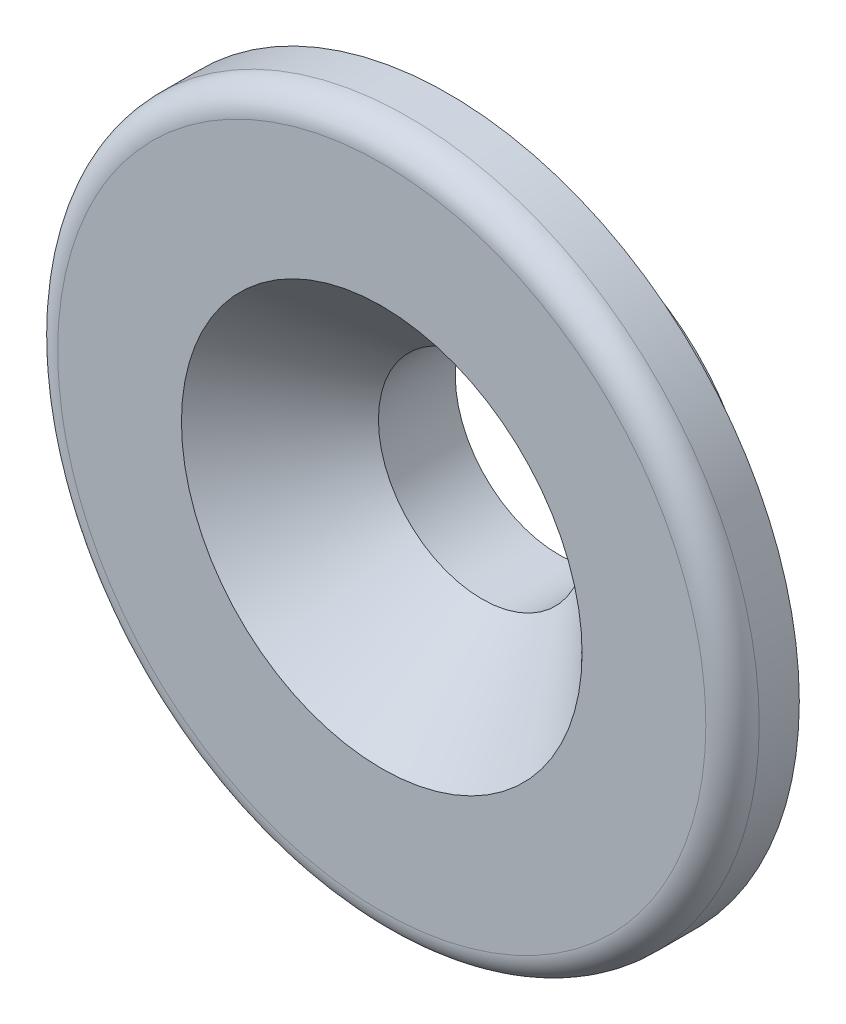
ISO-10303-21;
HEADER;
FILE_DESCRIPTION(('STEP AP214'),'2;1');
FILE_NAME('part.step','',(''),(''),'','','');
FILE_SCHEMA(('AUTOMOTIVE_DESIGN { 1 0 10303 214 1 1 1 1 }'));
ENDSEC;
DATA;
#1=APPLICATION_CONTEXT('core data for automotive mechanical design processes');
#2=APPLICATION_PROTOCOL_DEFINITION('international standard','automotive_design',2000,#1);
#3=PRODUCT_CONTEXT('',#1,'mechanical');
#4=PRODUCT('Part','Part','',(#3));
#5=PRODUCT_RELATED_PRODUCT_CATEGORY('part','',(#4));
#6=PRODUCT_DEFINITION_FORMATION('','',#4);
#7=PRODUCT_DEFINITION_CONTEXT('part definition',#1,'design');
#8=PRODUCT_DEFINITION('design','',#6,#7);
#9=PRODUCT_DEFINITION_SHAPE('','',#8);
#10=(LENGTH_UNIT() NAMED_UNIT(*) SI_UNIT(.MILLI.,.METRE.));
#11=(NAMED_UNIT(*) PLANE_ANGLE_UNIT() SI_UNIT($,.RADIAN.));
#12=(NAMED_UNIT(*) SI_UNIT($,.STERADIAN.) SOLID_ANGLE_UNIT());
#13=UNCERTAINTY_MEASURE_WITH_UNIT(LENGTH_MEASURE(1.E-05),#10,'distance_accuracy_value','');
#14=(GEOMETRIC_REPRESENTATION_CONTEXT(3) GLOBAL_UNCERTAINTY_ASSIGNED_CONTEXT((#13)) GLOBAL_UNIT_ASSIGNED_CONTEXT((#10,
#11,#12)) REPRESENTATION_CONTEXT('',''));
#15=CARTESIAN_POINT('',(0.,0.,0.));
#16=DIRECTION('',(0.,0.,1.));
#17=DIRECTION('',(1.,0.,0.));
#18=AXIS2_PLACEMENT_3D('',#15,#16,#17);
#19=CARTESIAN_POINT('',(0.,0.,2.285));
#20=DIRECTION('',(0.,0.,-1.));
#21=DIRECTION('',(-1.,0.,0.));
#22=AXIS2_PLACEMENT_3D('',#19,#20,#21);
#23=CYLINDRICAL_SURFACE('',#22,3.1);
#24=CARTESIAN_POINT('',(0.,0.,-0.99999999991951));
#25=DIRECTION('',(0.,0.,1.));
#26=DIRECTION('',(1.,0.,0.));
#27=AXIS2_PLACEMENT_3D('',#24,#25,#26);
#28=CIRCLE('',#27,3.10000000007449);
#29=CARTESIAN_POINT('',(3.10000000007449,0.,-0.99999999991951));
#30=VERTEX_POINT('',#29);
#31=EDGE_CURVE('E112',#30,#30,#28,.T.);
#32=ORIENTED_EDGE('',*,*,#31,.T.);
#33=EDGE_LOOP('',(#32));
#34=FACE_BOUND('',#33,.T.);
#35=CARTESIAN_POINT('',(0.,0.,-3.3));
#36=DIRECTION('',(0.,0.,-1.));
#37=DIRECTION('',(-1.,0.,0.));
#38=AXIS2_PLACEMENT_3D('',#35,#36,#37);
#39=CIRCLE('',#38,3.1);
#40=CARTESIAN_POINT('',(-3.1,0.,-3.3));
#41=VERTEX_POINT('',#40);
#42=EDGE_CURVE('E18',#41,#41,#39,.F.);
#43=ORIENTED_EDGE('',*,*,#42,.F.);
#44=EDGE_LOOP('',(#43));
#45=FACE_BOUND('',#44,.T.);
#46=ADVANCED_FACE('F14',(#34,#45),#23,.F.);
#47=CARTESIAN_POINT('',(0.,0.,2.00000000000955));
#48=DIRECTION('',(0.,0.,1.));
#49=DIRECTION('',(1.,0.,0.));
#50=AXIS2_PLACEMENT_3D('',#47,#48,#49);
#51=CONICAL_SURFACE('',#50,5.99700000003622,0.767933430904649);
#52=ORIENTED_EDGE('',*,*,#31,.F.);
#53=EDGE_LOOP('',(#52));
#54=FACE_BOUND('',#53,.T.);
#55=CARTESIAN_POINT('',(0.,0.,2.00000000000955));
#56=DIRECTION('',(0.,0.,1.));
#57=DIRECTION('',(1.,0.,0.));
#58=AXIS2_PLACEMENT_3D('',#55,#56,#57);
#59=CIRCLE('',#58,5.99700000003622);
#60=CARTESIAN_POINT('',(5.99700000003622,0.,2.00000000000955));
#61=VERTEX_POINT('',#60);
#62=EDGE_CURVE('E108',#61,#61,#59,.F.);
#63=ORIENTED_EDGE('',*,*,#62,.F.);
#64=EDGE_LOOP('',(#63));
#65=FACE_BOUND('',#64,.T.);
#66=ADVANCED_FACE('F72',(#54,#65),#51,.F.);
#67=CARTESIAN_POINT('',(0.,0.,-3.3));
#68=DIRECTION('',(0.,0.,-1.));
#69=DIRECTION('',(-1.,0.,0.));
#70=AXIS2_PLACEMENT_3D('',#67,#68,#69);
#71=PLANE('',#70);
#72=ORIENTED_EDGE('',*,*,#42,.T.);
#73=EDGE_LOOP('',(#72));
#74=FACE_BOUND('',#73,.T.);
#75=CARTESIAN_POINT('',(0.,0.,-3.3));
#76=DIRECTION('',(0.,0.,-1.));
#77=DIRECTION('',(-1.,0.,0.));
#78=AXIS2_PLACEMENT_3D('',#75,#76,#77);
#79=CIRCLE('',#78,5.9);
#80=CARTESIAN_POINT('',(-5.9,0.,-3.3));
#81=VERTEX_POINT('',#80);
#82=EDGE_CURVE('E105',#81,#81,#79,.F.);
#83=ORIENTED_EDGE('',*,*,#82,.F.);
#84=EDGE_LOOP('',(#83));
#85=FACE_BOUND('',#84,.T.);
#86=ADVANCED_FACE('F76',(#74,#85),#71,.T.);
#87=CARTESIAN_POINT('',(0.,0.,2.));
#88=DIRECTION('',(0.,0.,1.));
#89=DIRECTION('',(1.,0.,0.));
#90=AXIS2_PLACEMENT_3D('',#87,#88,#89);
#91=PLANE('',#90);
#92=DIRECTION('',(0.00354501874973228,0.99999371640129,0.));
#93=VECTOR('',#92,1.);
#94=CARTESIAN_POINT('',(-9.699999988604,0.,2.));
#95=LINE('',#94,#93);
#96=CARTESIAN_POINT('',(-9.69975517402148,0.0690583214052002,1.99999999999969));
#97=VERTEX_POINT('',#96);
#98=CARTESIAN_POINT('',(-9.699999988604,0.,2.));
#99=VERTEX_POINT('',#98);
#100=EDGE_CURVE('E31',#97,#99,#95,.F.);
#101=ORIENTED_EDGE('',*,*,#100,.T.);
#102=CARTESIAN_POINT('',(9.69975517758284,-0.0690583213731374,1.99999999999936));
#103=CARTESIAN_POINT('',(9.69915226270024,-0.152460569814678,1.99999999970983));
#104=CARTESIAN_POINT('',(9.69748034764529,-0.235855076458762,1.99999999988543));
#105=CARTESIAN_POINT('',(9.69200030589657,-0.402573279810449,2.00000000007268));
#106=CARTESIAN_POINT('',(9.68819219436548,-0.485896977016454,2.00000000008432));
#107=CARTESIAN_POINT('',(9.6784415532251,-0.652419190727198,1.99999999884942));
#108=CARTESIAN_POINT('',(9.67249902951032,-0.735617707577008,1.99999999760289));
#109=CARTESIAN_POINT('',(9.65848575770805,-0.901835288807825,1.99999998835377));
#110=CARTESIAN_POINT('',(9.65041500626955,-0.984854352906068,1.99999998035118));
#111=CARTESIAN_POINT('',(9.63214214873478,-1.15065885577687,1.99999995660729));
#112=CARTESIAN_POINT('',(9.62194003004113,-1.23344429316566,1.99999994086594));
#113=CARTESIAN_POINT('',(9.60506675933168,-1.35740726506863,1.99999989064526));
#114=CARTESIAN_POINT('',(9.59918056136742,-1.39869296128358,1.99999986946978));
#115=CARTESIAN_POINT('',(9.59005901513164,-1.45969662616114,1.99999984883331));
#116=CARTESIAN_POINT('',(9.58703997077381,-1.47944696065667,1.99999984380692));
#117=CARTESIAN_POINT('',(9.57334689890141,-1.56711857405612,1.9999998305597));
#118=CARTESIAN_POINT('',(9.56197768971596,-1.63493146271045,1.99999984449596));
#119=CARTESIAN_POINT('',(9.52527440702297,-1.84036993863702,1.99999988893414));
#120=CARTESIAN_POINT('',(9.49766715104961,-1.97759796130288,1.99999992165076));
#121=CARTESIAN_POINT('',(9.44771214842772,-2.20077956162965,1.99999996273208));
#122=CARTESIAN_POINT('',(9.42713208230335,-2.28713514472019,1.99999997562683));
#123=CARTESIAN_POINT('',(9.38382566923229,-2.45841161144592,1.99999999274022));
#124=CARTESIAN_POINT('',(9.36112227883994,-2.54333826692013,1.99999999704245));
#125=CARTESIAN_POINT('',(9.32287741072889,-2.67904291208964,1.99999999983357));
#126=CARTESIAN_POINT('',(9.30805980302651,-2.7300267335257,1.99999999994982));
#127=CARTESIAN_POINT('',(9.26254746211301,-2.88201306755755,2.00000000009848));
#128=CARTESIAN_POINT('',(9.23063350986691,-2.98265414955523,1.9999999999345));
#129=CARTESIAN_POINT('',(9.16352906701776,-3.18283546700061,1.99999999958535));
#130=CARTESIAN_POINT('',(9.12833858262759,-3.28237570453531,1.99999999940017));
#131=CARTESIAN_POINT('',(9.05473099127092,-3.48025628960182,1.99999999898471));
#132=CARTESIAN_POINT('',(9.01631388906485,-3.57859663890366,1.99999999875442));
#133=CARTESIAN_POINT('',(8.93629063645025,-3.77397090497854,1.99999999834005));
#134=CARTESIAN_POINT('',(8.89468448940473,-3.87100482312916,1.99999999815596));
#135=CARTESIAN_POINT('',(8.80832834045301,-4.06366342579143,1.99999999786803));
#136=CARTESIAN_POINT('',(8.7635783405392,-4.15928811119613,1.99999999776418));
#137=CARTESIAN_POINT('',(8.6709818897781,-4.34902631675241,1.99999999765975));
#138=CARTESIAN_POINT('',(8.62313543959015,-4.44313983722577,1.99999999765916));
#139=CARTESIAN_POINT('',(8.52439709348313,-4.62975555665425,1.99999999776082));
#140=CARTESIAN_POINT('',(8.47350519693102,-4.72225775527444,1.99999999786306));
#141=CARTESIAN_POINT('',(8.36873010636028,-4.90555234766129,1.99999999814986));
#142=CARTESIAN_POINT('',(8.31484691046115,-4.99634474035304,1.99999999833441));
#143=CARTESIAN_POINT('',(8.2041466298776,-5.17612305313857,1.99999999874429));
#144=CARTESIAN_POINT('',(8.14732954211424,-5.26510897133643,1.99999999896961));
#145=CARTESIAN_POINT('',(8.03082179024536,-5.44117964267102,1.99999999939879));
#146=CARTESIAN_POINT('',(7.97113112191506,-5.52826439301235,1.99999999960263));
#147=CARTESIAN_POINT('',(7.84894036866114,-5.70043984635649,1.99999999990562));
#148=CARTESIAN_POINT('',(7.78644027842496,-5.78553054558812,2.00000000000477));
#149=CARTESIAN_POINT('',(7.65256709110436,-5.96169136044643,1.99999999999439));
#150=CARTESIAN_POINT('',(7.58091799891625,-6.0525519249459,1.99999999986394));
#151=CARTESIAN_POINT('',(7.43319797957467,-6.23313797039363,1.9999999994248));
#152=CARTESIAN_POINT('',(7.35707337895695,-6.3228195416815,1.99999999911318));
#153=CARTESIAN_POINT('',(7.20034250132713,-6.50079654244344,1.99999999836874));
#154=CARTESIAN_POINT('',(7.11968332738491,-6.58904539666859,1.99999999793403));
#155=CARTESIAN_POINT('',(6.95383536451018,-6.7638950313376,1.99999999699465));
#156=CARTESIAN_POINT('',(6.86859460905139,-6.85044652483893,1.99999999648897));
#157=CARTESIAN_POINT('',(6.69354845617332,-7.02163009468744,1.99999999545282));
#158=CARTESIAN_POINT('',(6.60369218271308,-7.10621015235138,1.99999999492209));
#159=CARTESIAN_POINT('',(6.4193938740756,-7.27317021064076,1.99999999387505));
#160=CARTESIAN_POINT('',(6.32490221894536,-7.35549544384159,1.99999999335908));
#161=CARTESIAN_POINT('',(6.1313269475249,-7.51765650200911,1.99999999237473));
#162=CARTESIAN_POINT('',(6.0321951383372,-7.59743480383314,1.99999999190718));
#163=CARTESIAN_POINT('',(5.82934929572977,-7.75420449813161,1.9999999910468));
#164=CARTESIAN_POINT('',(5.72558867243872,-7.83113561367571,1.9999999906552));
#165=CARTESIAN_POINT('',(5.51351189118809,-7.98190596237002,1.99999998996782));
#166=CARTESIAN_POINT('',(5.40515092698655,-8.05568217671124,1.99999998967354));
#167=CARTESIAN_POINT('',(5.18391811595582,-8.19983103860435,1.99999998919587));
#168=CARTESIAN_POINT('',(5.07100343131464,-8.27013794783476,1.99999998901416));
#169=CARTESIAN_POINT('',(4.84072679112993,-8.40703066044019,1.99999998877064));
#170=CARTESIAN_POINT('',(4.7233241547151,-8.47354803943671,1.99999998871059));
#171=CARTESIAN_POINT('',(4.48415515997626,-8.60253925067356,1.99999998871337));
#172=CARTESIAN_POINT('',(4.36235046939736,-8.66494201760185,1.99999998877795));
#173=CARTESIAN_POINT('',(4.11448180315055,-8.7853777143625,1.99999998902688));
#174=CARTESIAN_POINT('',(3.9883820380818,-8.84333699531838,1.99999998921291));
#175=CARTESIAN_POINT('',(3.73204946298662,-8.95455673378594,1.99999998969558));
#176=CARTESIAN_POINT('',(3.60178360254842,-9.00774102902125,1.99999998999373));
#177=CARTESIAN_POINT('',(3.33726775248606,-9.10908037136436,1.99999999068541));
#178=CARTESIAN_POINT('',(3.20298764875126,-9.15715682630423,1.9999999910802));
#179=CARTESIAN_POINT('',(2.93061572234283,-9.24794998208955,1.99999999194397));
#180=CARTESIAN_POINT('',(2.79249691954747,-9.29058575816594,1.99999999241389));
#181=CARTESIAN_POINT('',(2.51264426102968,-9.37016844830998,1.99999999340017));
#182=CARTESIAN_POINT('',(2.37088675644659,-9.40703221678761,1.99999999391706));
#183=CARTESIAN_POINT('',(2.08397828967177,-9.4747446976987,1.99999999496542));
#184=CARTESIAN_POINT('',(1.93880720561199,-9.50550816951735,1.999999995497));
#185=CARTESIAN_POINT('',(1.64531875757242,-9.56069865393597,1.99999999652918));
#186=CARTESIAN_POINT('',(1.49698499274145,-9.58503847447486,1.99999999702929));
#187=CARTESIAN_POINT('',(1.19744427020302,-9.62706604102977,1.99999999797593));
#188=CARTESIAN_POINT('',(1.04622482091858,-9.64466479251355,1.99999999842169));
#189=CARTESIAN_POINT('',(0.741212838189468,-9.67290522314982,1.99999999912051));
#190=CARTESIAN_POINT('',(0.587411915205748,-9.68345630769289,1.99999999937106));
#191=CARTESIAN_POINT('',(0.277561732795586,-9.69729774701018,1.99999999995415));
#192=CARTESIAN_POINT('',(0.121508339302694,-9.70049598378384,2.00000000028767));
#193=CARTESIAN_POINT('',(-0.180258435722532,-9.69941791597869,1.99999999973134));
#194=CARTESIAN_POINT('',(-0.325973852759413,-9.69562143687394,1.99999999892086));
#195=CARTESIAN_POINT('',(-0.617091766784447,-9.68149043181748,2.00000000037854));
#196=CARTESIAN_POINT('',(-0.762494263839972,-9.67115590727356,2.00000000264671));
#197=CARTESIAN_POINT('',(-1.01641026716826,-9.64741140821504,1.9999999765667));
#198=CARTESIAN_POINT('',(-1.12505955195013,-9.63541593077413,1.99999995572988));
#199=CARTESIAN_POINT('',(-1.43177423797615,-9.5961742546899,1.99999993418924));
#200=CARTESIAN_POINT('',(-1.6292973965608,-9.56452899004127,1.99999996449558));
#201=CARTESIAN_POINT('',(-1.97726843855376,-9.49770974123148,1.99999999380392));
#202=CARTESIAN_POINT('',(-2.12819296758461,-9.46498053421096,1.99999999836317));
#203=CARTESIAN_POINT('',(-2.32321677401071,-9.41780745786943,1.99999999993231));
#204=CARTESIAN_POINT('',(-2.36811216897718,-9.40660868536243,1.99999999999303));
#205=CARTESIAN_POINT('',(-2.4813953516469,-9.3775006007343,2.00000000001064));
#206=CARTESIAN_POINT('',(-2.54967518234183,-9.35916926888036,1.99999999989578));
#207=CARTESIAN_POINT('',(-2.75388611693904,-9.30194848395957,2.00000000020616));
#208=CARTESIAN_POINT('',(-2.88919712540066,-9.26083026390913,2.00000000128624));
#209=CARTESIAN_POINT('',(-3.19150214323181,-9.16174657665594,1.999999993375));
#210=CARTESIAN_POINT('',(-3.35796170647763,-9.10213900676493,1.99999998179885));
#211=CARTESIAN_POINT('',(-3.62142625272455,-8.99956773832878,1.99999994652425));
#212=CARTESIAN_POINT('',(-3.71956693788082,-8.95948984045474,1.99999992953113));
#213=CARTESIAN_POINT('',(-3.94695503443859,-8.86220870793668,1.99999991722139));
#214=CARTESIAN_POINT('',(-4.07566901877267,-8.80374951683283,1.99999993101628));
#215=CARTESIAN_POINT('',(-4.3303405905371,-8.68112882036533,1.99999996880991));
#216=CARTESIAN_POINT('',(-4.4562982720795,-8.61696751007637,1.99999999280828));
#217=CARTESIAN_POINT('',(-4.67161571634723,-8.50153300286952,2.00000000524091));
#218=CARTESIAN_POINT('',(-4.76163488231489,-8.45148484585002,2.00000000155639));
#219=CARTESIAN_POINT('',(-4.92081759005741,-8.35962257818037,1.999999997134));
#220=CARTESIAN_POINT('',(-4.99029752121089,-8.31835640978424,1.99999999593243));
#221=CARTESIAN_POINT('',(-5.13831119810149,-8.22792814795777,1.9999999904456));
#222=CARTESIAN_POINT('',(-5.21667973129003,-8.17849511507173,1.99999998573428));
#223=CARTESIAN_POINT('',(-5.37016568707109,-8.07856119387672,1.9999999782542));
#224=CARTESIAN_POINT('',(-5.44531639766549,-8.028111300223,1.9999999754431));
#225=CARTESIAN_POINT('',(-5.6568363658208,-7.88175513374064,1.99999997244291));
#226=CARTESIAN_POINT('',(-5.79148116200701,-7.78333650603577,1.99999997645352));
#227=CARTESIAN_POINT('',(-6.02909224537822,-7.60004407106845,1.99999998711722));
#228=CARTESIAN_POINT('',(-6.13300894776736,-7.51639745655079,1.99999999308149));
#229=CARTESIAN_POINT('',(-6.28621321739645,-7.38775493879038,1.99999999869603));
#230=CARTESIAN_POINT('',(-6.3368371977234,-7.34434440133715,2.00000000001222));
#231=CARTESIAN_POINT('',(-6.43329791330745,-7.2598927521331,1.99999999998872));
#232=CARTESIAN_POINT('',(-6.47920185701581,-7.21892837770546,1.99999999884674));
#233=CARTESIAN_POINT('',(-6.61574179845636,-7.09475217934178,1.99999999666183));
#234=CARTESIAN_POINT('',(-6.7052110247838,-7.01025296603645,1.99999999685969));
#235=CARTESIAN_POINT('',(-6.90287960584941,-6.81641435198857,1.99999999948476));
#236=CARTESIAN_POINT('',(-7.01017073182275,-6.70614539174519,2.00000000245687));
#237=CARTESIAN_POINT('',(-7.17750409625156,-6.52577320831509,1.99999997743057));
#238=CARTESIAN_POINT('',(-7.23926963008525,-6.45725877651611,1.999999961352));
#239=CARTESIAN_POINT('',(-7.38104782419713,-6.29533729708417,1.99999994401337));
#240=CARTESIAN_POINT('',(-7.46028101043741,-6.20124453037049,1.99999994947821));
#241=CARTESIAN_POINT('',(-7.61499318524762,-6.01002995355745,1.99999997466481));
#242=CARTESIAN_POINT('',(-7.69047227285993,-5.91290822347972,1.99999999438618));
#243=CARTESIAN_POINT('',(-7.81493276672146,-5.74660827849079,2.00000000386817));
#244=CARTESIAN_POINT('',(-7.86485545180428,-5.67813189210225,2.00000000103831));
#245=CARTESIAN_POINT('',(-7.95361524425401,-5.55295026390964,1.99999999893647));
#246=CARTESIAN_POINT('',(-7.99276429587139,-5.49646621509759,1.99999999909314));
#247=CARTESIAN_POINT('',(-8.07540291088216,-5.37449189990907,1.99999999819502));
#248=CARTESIAN_POINT('',(-8.11870633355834,-5.30887534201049,1.99999999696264));
#249=CARTESIAN_POINT('',(-8.20145353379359,-5.18010024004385,1.99999999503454));
#250=CARTESIAN_POINT('',(-8.24098036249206,-5.11699493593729,1.9999999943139));
#251=CARTESIAN_POINT('',(-8.35232257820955,-4.93458158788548,1.99999999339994));
#252=CARTESIAN_POINT('',(-8.42230691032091,-4.81414779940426,1.99999999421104));
#253=CARTESIAN_POINT('',(-8.54353891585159,-4.5947550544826,1.99999999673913));
#254=CARTESIAN_POINT('',(-8.59573471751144,-4.49631799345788,1.99999999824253));
#255=CARTESIAN_POINT('',(-8.67145229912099,-4.34735602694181,1.99999999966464));
#256=CARTESIAN_POINT('',(-8.69626251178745,-4.29748350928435,1.99999999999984));
#257=CARTESIAN_POINT('',(-8.74245814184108,-4.20258155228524,2.00000000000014));
#258=CARTESIAN_POINT('',(-8.763929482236,-4.15759390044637,1.99999999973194));
#259=CARTESIAN_POINT('',(-8.82730243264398,-4.02214481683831,1.99999999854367));
#260=CARTESIAN_POINT('',(-8.86816449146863,-3.93119425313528,1.99999999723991));
#261=CARTESIAN_POINT('',(-8.9470720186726,-3.74808169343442,1.99999999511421));
#262=CARTESIAN_POINT('',(-8.98511749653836,-3.65591970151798,1.99999999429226));
#263=CARTESIAN_POINT('',(-9.05835759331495,-3.47046934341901,1.99999999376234));
#264=CARTESIAN_POINT('',(-9.09355221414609,-3.37718097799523,1.99999999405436));
#265=CARTESIAN_POINT('',(-9.1610567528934,-3.18956641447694,1.99999999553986));
#266=CARTESIAN_POINT('',(-9.19336666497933,-3.0952402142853,1.99999999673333));
#267=CARTESIAN_POINT('',(-9.25507244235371,-2.90563827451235,1.99999999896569));
#268=CARTESIAN_POINT('',(-9.28446829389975,-2.81036253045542,2.00000000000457));
#269=CARTESIAN_POINT('',(-9.33574217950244,-2.63462416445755,1.99999999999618));
#270=CARTESIAN_POINT('',(-9.35806306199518,-2.55429040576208,1.99999999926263));
#271=CARTESIAN_POINT('',(-9.40062818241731,-2.39307368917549,1.9999999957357));
#272=CARTESIAN_POINT('',(-9.42087240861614,-2.31219072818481,1.99999999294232));
#273=CARTESIAN_POINT('',(-9.45927101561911,-2.14992977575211,1.99999998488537));
#274=CARTESIAN_POINT('',(-9.47742538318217,-2.06855178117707,1.99999997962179));
#275=CARTESIAN_POINT('',(-9.51163313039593,-1.90535499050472,1.99999996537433));
#276=CARTESIAN_POINT('',(-9.52768649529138,-1.82353619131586,1.99999995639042));
#277=CARTESIAN_POINT('',(-9.55767768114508,-1.65951023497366,1.99999993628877));
#278=CARTESIAN_POINT('',(-9.57161548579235,-1.57730307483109,1.99999992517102));
#279=CARTESIAN_POINT('',(-9.59093966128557,-1.45374643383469,1.99999989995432));
#280=CARTESIAN_POINT('',(-9.59711737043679,-1.412519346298,1.99999989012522));
#281=CARTESIAN_POINT('',(-9.60623396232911,-1.34879559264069,1.99999988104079));
#282=CARTESIAN_POINT('',(-9.60936568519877,-1.32632648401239,1.99999987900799));
#283=CARTESIAN_POINT('',(-9.62190481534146,-1.23391713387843,1.99999987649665));
#284=CARTESIAN_POINT('',(-9.63060629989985,-1.16388076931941,1.99999988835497));
#285=CARTESIAN_POINT('',(-9.65376448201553,-0.959156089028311,1.99999992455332));
#286=CARTESIAN_POINT('',(-9.66615735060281,-0.824227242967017,1.99999995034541));
#287=CARTESIAN_POINT('',(-9.68156855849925,-0.606397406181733,1.99999997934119));
#288=CARTESIAN_POINT('',(-9.68635857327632,-0.523615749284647,1.99999998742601));
#289=CARTESIAN_POINT('',(-9.69400483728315,-0.353907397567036,1.9999999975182));
#290=CARTESIAN_POINT('',(-9.69675516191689,-0.26697581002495,1.9999999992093));
#291=CARTESIAN_POINT('',(-9.69944922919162,-0.12002196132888,2.00000000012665));
#292=CARTESIAN_POINT('',(-9.69999863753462,-0.0600102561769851,1.9999999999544));
#293=CARTESIAN_POINT('',(-9.699999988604,3.12109983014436E-11,2.));
#294=B_SPLINE_CURVE_WITH_KNOTS('',3,(#102,#103,#104,#105,#106,#107,#108,#109,#110,#111,#112,
#113,#114,#115,#116,#117,#118,#119,#120,#121,#122,#123,#124,#125,#126,#127,#128,#129,#130,#131,
#132,#133,#134,#135,#136,#137,#138,#139,#140,#141,#142,#143,#144,#145,#146,#147,#148,#149,#150,
#151,#152,#153,#154,#155,#156,#157,#158,#159,#160,#161,#162,#163,#164,#165,#166,#167,#168,#169,
#170,#171,#172,#173,#174,#175,#176,#177,#178,#179,#180,#181,#182,#183,#184,#185,#186,#187,#188,
#189,#190,#191,#192,#193,#194,#195,#196,#197,#198,#199,#200,#201,#202,#203,#204,#205,#206,#207,
#208,#209,#210,#211,#212,#213,#214,#215,#216,#217,#218,#219,#220,#221,#222,#223,#224,#225,#226,
#227,#228,#229,#230,#231,#232,#233,#234,#235,#236,#237,#238,#239,#240,#241,#242,#243,#244,#245,
#246,#247,#248,#249,#250,#251,#252,#253,#254,#255,#256,#257,#258,#259,#260,#261,#262,#263,#264,
#265,#266,#267,#268,#269,#270,#271,#272,#273,#274,#275,#276,#277,#278,#279,#280,#281,#282,#283,
#284,#285,#286,#287,#288,#289,#290,#291,#292,#293),.UNSPECIFIED.,.F.,.F.,(4,2,2,2,2,2,2,2,2,2,2,
2,2,2,2,2,2,2,2,2,2,2,2,2,2,2,2,2,2,2,2,2,2,2,2,2,2,2,2,2,2,2,2,2,2,2,2,2,2,2,2,2,2,2,2,2,2,2,2,
2,2,2,2,2,2,2,2,2,2,2,2,2,2,2,2,2,2,2,2,2,2,2,2,2,2,2,2,2,2,2,2,2,2,2,2,4),(0.,
0.250206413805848,0.500411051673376,0.750614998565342,1.00081933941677,1.2510251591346,
1.37613153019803,1.43607037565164,1.64233444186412,2.0621135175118,2.32840790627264,
2.59209819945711,2.75137365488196,3.06805201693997,3.38472977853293,3.70140707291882,
4.01808403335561,4.3347607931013,4.65143748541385,4.96811424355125,5.28479120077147,
5.60146849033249,5.9181462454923,6.23482459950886,6.58188508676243,6.93470926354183,
7.29329704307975,7.65764833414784,8.02776304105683,8.40364106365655,8.78528229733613,
9.17268663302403,9.56585395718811,9.96478415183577,10.369477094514,10.7799326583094,
11.1961507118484,11.6181311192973,12.0458737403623,12.4793784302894,12.9186450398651,
13.3636734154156,13.8144633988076,14.2710148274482,14.7333275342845,15.2014013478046,
15.6385532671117,16.0757050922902,16.4035834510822,17.003272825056,17.4663939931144,
17.6052038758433,17.817281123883,18.2414095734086,18.7715495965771,19.08952882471,
19.5134808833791,19.937418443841,20.2463596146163,20.488767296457,20.7666962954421,
21.0382093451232,21.5383003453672,21.9383845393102,22.1384349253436,22.3229982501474,
22.6921048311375,23.153472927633,23.4301781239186,23.7991064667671,24.1680250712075,
24.4222264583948,24.6283856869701,24.8642133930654,25.0875844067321,25.5053141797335,
25.8395056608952,26.006606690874,26.1561482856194,26.4552213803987,26.7542934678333,
27.0533653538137,27.3524378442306,27.6515117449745,27.9016162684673,28.1517222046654,
28.4018297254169,28.6519390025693,28.9020502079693,29.027109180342,29.0951675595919,
29.3068768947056,29.713228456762,29.9619664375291,30.2228583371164,30.4028899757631),.UNSPECIFIED.);
#295=CARTESIAN_POINT('',(9.69975415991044,-0.0690583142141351,2.));
#296=VERTEX_POINT('',#295);
#297=EDGE_CURVE('E43',#296,#99,#294,.T.);
#298=ORIENTED_EDGE('',*,*,#297,.F.);
#299=CARTESIAN_POINT('',(-2.22044604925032E-13,-3.12775386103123E-11,2.));
#300=DIRECTION('',(0.,0.,-1.));
#301=DIRECTION('',(-1.,0.,0.));
#302=AXIS2_PLACEMENT_3D('',#299,#300,#301);
#303=CIRCLE('',#302,9.69999998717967);
#304=CARTESIAN_POINT('',(9.699999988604,0.,2.));
#305=VERTEX_POINT('',#304);
#306=EDGE_CURVE('E39',#305,#296,#303,.T.);
#307=ORIENTED_EDGE('',*,*,#306,.F.);
#308=CARTESIAN_POINT('',(-9.69975517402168,0.0690583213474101,1.99999999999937));
#309=CARTESIAN_POINT('',(-9.69915225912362,0.152460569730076,1.99999999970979));
#310=CARTESIAN_POINT('',(-9.69748034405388,0.235855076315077,1.99999999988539));
#311=CARTESIAN_POINT('',(-9.69200030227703,0.402573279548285,2.00000000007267));
#312=CARTESIAN_POINT('',(-9.68819219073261,0.485896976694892,2.00000000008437));
#313=CARTESIAN_POINT('',(-9.6784415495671,0.652419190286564,1.99999999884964));
#314=CARTESIAN_POINT('',(-9.67249902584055,0.735617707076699,1.99999999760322));
#315=CARTESIAN_POINT('',(-9.6584857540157,0.90183528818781,1.99999998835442));
#316=CARTESIAN_POINT('',(-9.65041500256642,0.984854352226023,1.99999998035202));
#317=CARTESIAN_POINT('',(-9.63214214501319,1.15065885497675,1.99999995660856));
#318=CARTESIAN_POINT('',(-9.62194002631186,1.2334442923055,1.99999994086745));
#319=CARTESIAN_POINT('',(-9.60506675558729,1.35740726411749,1.99999989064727));
#320=CARTESIAN_POINT('',(-9.59918055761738,1.39869296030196,1.99999986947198));
#321=CARTESIAN_POINT('',(-9.59005901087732,1.4596966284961,1.99999984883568));
#322=CARTESIAN_POINT('',(-9.58703996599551,1.47944696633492,1.99999984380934));
#323=CARTESIAN_POINT('',(-9.57334689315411,1.56711858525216,1.99999983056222));
#324=CARTESIAN_POINT('',(-9.56197768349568,1.6349314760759,1.99999984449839));
#325=CARTESIAN_POINT('',(-9.52527440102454,1.84036994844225,1.99999988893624));
#326=CARTESIAN_POINT('',(-9.49766714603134,1.97759796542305,1.99999992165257));
#327=CARTESIAN_POINT('',(-9.44771214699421,2.20077954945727,1.99999996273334));
#328=CARTESIAN_POINT('',(-9.42713208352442,2.2871351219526,1.99999997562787));
#329=CARTESIAN_POINT('',(-9.38382567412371,2.45841157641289,1.99999999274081));
#330=CARTESIAN_POINT('',(-9.36112228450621,2.54333823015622,1.99999999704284));
#331=CARTESIAN_POINT('',(-9.32287741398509,2.67904288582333,1.99999999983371));
#332=CARTESIAN_POINT('',(-9.3080598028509,2.7300267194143,1.99999999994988));
#333=CARTESIAN_POINT('',(-9.26254745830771,2.88201306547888,2.00000000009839));
#334=CARTESIAN_POINT('',(-9.2306335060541,2.98265414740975,1.99999999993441));
#335=CARTESIAN_POINT('',(-9.16352906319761,3.18283546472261,1.99999999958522));
#336=CARTESIAN_POINT('',(-9.12833857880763,3.28237570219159,1.99999999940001));
#337=CARTESIAN_POINT('',(-9.05473098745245,3.48025628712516,1.99999999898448));
#338=CARTESIAN_POINT('',(-9.01631388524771,3.57859663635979,1.99999999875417));
#339=CARTESIAN_POINT('',(-8.9362906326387,3.77397090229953,1.99999999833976));
#340=CARTESIAN_POINT('',(-8.89468448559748,3.87100482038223,1.99999999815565));
#341=CARTESIAN_POINT('',(-8.80832833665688,4.06366342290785,1.99999999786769));
#342=CARTESIAN_POINT('',(-8.76357833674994,4.15928810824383,1.99999999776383));
#343=CARTESIAN_POINT('',(-8.67098188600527,4.34902631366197,1.99999999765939));
#344=CARTESIAN_POINT('',(-8.62313543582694,4.44313983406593,1.9999999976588));
#345=CARTESIAN_POINT('',(-8.52439708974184,4.62975555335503,1.99999999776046));
#346=CARTESIAN_POINT('',(-8.47350519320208,4.72225775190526,1.99999999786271));
#347=CARTESIAN_POINT('',(-8.36873010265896,4.90555234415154,1.99999999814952));
#348=CARTESIAN_POINT('',(-8.31484690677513,4.99634473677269,1.99999999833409));
#349=CARTESIAN_POINT('',(-8.20414662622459,5.17612304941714,1.999999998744));
#350=CARTESIAN_POINT('',(-8.14732953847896,5.26510896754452,1.99999999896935));
#351=CARTESIAN_POINT('',(-8.03082178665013,5.4411796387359,1.99999999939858));
#352=CARTESIAN_POINT('',(-7.97113111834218,5.5282643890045,1.99999999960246));
#353=CARTESIAN_POINT('',(-7.84894036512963,5.70043984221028,1.99999999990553));
#354=CARTESIAN_POINT('',(-7.78644027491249,5.78553054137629,2.00000000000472));
#355=CARTESIAN_POINT('',(-7.65256722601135,5.96169117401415,1.99999999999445));
#356=CARTESIAN_POINT('',(-7.58091827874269,6.05255156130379,1.99999999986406));
#357=CARTESIAN_POINT('',(-7.43319854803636,6.23313727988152,1.99999999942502));
#358=CARTESIAN_POINT('',(-7.35707409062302,6.32281870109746,1.99999999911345));
#359=CARTESIAN_POINT('',(-7.20034349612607,6.50079542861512,1.99999999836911));
#360=CARTESIAN_POINT('',(-7.11968446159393,6.58904415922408,1.99999999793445));
#361=CARTESIAN_POINT('',(-6.95383677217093,6.76389357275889,1.99999999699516));
#362=CARTESIAN_POINT('',(-6.8685961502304,6.85044496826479,1.99999999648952));
#363=CARTESIAN_POINT('',(-6.69355025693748,7.02162836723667,1.99999999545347));
#364=CARTESIAN_POINT('',(-6.60369410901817,7.10620835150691,1.99999999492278));
#365=CARTESIAN_POINT('',(-6.41939604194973,7.27316828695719,1.99999999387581));
#366=CARTESIAN_POINT('',(-6.32490450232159,7.3554934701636,1.99999999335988));
#367=CARTESIAN_POINT('',(-6.13132945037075,7.51765445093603,1.99999999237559));
#368=CARTESIAN_POINT('',(-6.03219774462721,7.59743272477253,1.99999999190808));
#369=CARTESIAN_POINT('',(-5.82935209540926,7.75420238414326,1.99999999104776));
#370=CARTESIAN_POINT('',(-5.72559156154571,7.83113349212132,1.99999999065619));
#371=CARTESIAN_POINT('',(-5.51351494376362,7.98190384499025,1.99999998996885));
#372=CARTESIAN_POINT('',(-5.4051540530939,8.05568007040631,1.99999998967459));
#373=CARTESIAN_POINT('',(-5.18392137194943,8.19982897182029,1.99999998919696));
#374=CARTESIAN_POINT('',(-5.07100674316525,8.27013590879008,1.99999998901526));
#375=CARTESIAN_POINT('',(-4.84073019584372,8.40702869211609,1.99999998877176));
#376=CARTESIAN_POINT('',(-4.7233275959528,8.47354611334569,1.99999998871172));
#377=CARTESIAN_POINT('',(-4.4841586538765,8.60253742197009,1.99999998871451));
#378=CARTESIAN_POINT('',(-4.36235397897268,8.66494024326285,1.99999998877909));
#379=CARTESIAN_POINT('',(-4.1144853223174,8.78537605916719,1.99999998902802));
#380=CARTESIAN_POINT('',(-3.98838555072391,8.8433354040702,1.99999998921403));
#381=CARTESIAN_POINT('',(-3.73205293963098,8.95455527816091,1.99999998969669));
#382=CARTESIAN_POINT('',(-3.60178704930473,9.00773964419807,1.99999998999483));
#383=CARTESIAN_POINT('',(-3.33727111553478,9.10907913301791,1.99999999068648));
#384=CARTESIAN_POINT('',(-3.20299095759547,9.15715566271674,1.99999999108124));
#385=CARTESIAN_POINT('',(-2.93061889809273,9.24794896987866,1.99999999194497));
#386=CARTESIAN_POINT('',(-2.79250001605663,9.29058482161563,1.99999999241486));
#387=CARTESIAN_POINT('',(-2.51264717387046,9.37016766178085,1.99999999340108));
#388=CARTESIAN_POINT('',(-2.37088956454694,9.40703150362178,1.99999999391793));
#389=CARTESIAN_POINT('',(-2.08398086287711,9.4747441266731,1.99999999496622));
#390=CARTESIAN_POINT('',(-1.93880964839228,9.50550766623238,1.99999999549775));
#391=CARTESIAN_POINT('',(-1.64532091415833,9.56069827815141,1.99999999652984));
#392=CARTESIAN_POINT('',(-1.49698699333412,9.58503815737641,1.99999999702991));
#393=CARTESIAN_POINT('',(-1.19744593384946,9.62706582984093,1.99999999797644));
#394=CARTESIAN_POINT('',(-1.04622630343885,9.644664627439,1.99999999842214));
#395=CARTESIAN_POINT('',(-0.741213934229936,9.67290513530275,1.99999999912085));
#396=CARTESIAN_POINT('',(-0.587412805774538,9.68345624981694,1.99999999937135));
#397=CARTESIAN_POINT('',(-0.277562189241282,9.69729773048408,1.99999999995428));
#398=CARTESIAN_POINT('',(-0.121508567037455,9.7004959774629,2.00000000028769));
#399=CARTESIAN_POINT('',(0.180258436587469,9.69941790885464,1.99999999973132));
#400=CARTESIAN_POINT('',(0.325973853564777,9.69562142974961,1.9999999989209));
#401=CARTESIAN_POINT('',(0.617091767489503,9.68149042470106,2.00000000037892));
#402=CARTESIAN_POINT('',(0.762494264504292,9.67115590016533,2.00000000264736));
#403=CARTESIAN_POINT('',(1.01641026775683,9.64741140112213,1.99999997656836));
#404=CARTESIAN_POINT('',(1.12505955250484,9.63541592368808,1.99999995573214));
#405=CARTESIAN_POINT('',(1.43177423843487,9.59617424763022,1.99999993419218));
#406=CARTESIAN_POINT('',(1.62929739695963,9.56452898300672,1.99999996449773));
#407=CARTESIAN_POINT('',(1.97726843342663,9.49770973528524,1.99999999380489));
#408=CARTESIAN_POINT('',(2.12819295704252,9.46498052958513,1.9999999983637));
#409=CARTESIAN_POINT('',(2.32321676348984,9.41780745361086,1.99999999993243));
#410=CARTESIAN_POINT('',(2.3681121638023,9.40660867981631,1.99999999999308));
#411=CARTESIAN_POINT('',(2.48139535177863,9.37750059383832,2.00000000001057));
#412=CARTESIAN_POINT('',(2.54967518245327,9.359169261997,1.99999999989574));
#413=CARTESIAN_POINT('',(2.75388611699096,9.30194847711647,2.00000000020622));
#414=CARTESIAN_POINT('',(2.88919712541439,9.26083025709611,2.00000000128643));
#415=CARTESIAN_POINT('',(3.19150214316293,9.16174656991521,1.99999999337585));
#416=CARTESIAN_POINT('',(3.35796170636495,9.10213900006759,1.99999998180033));
#417=CARTESIAN_POINT('',(3.62142625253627,8.99956773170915,1.99999994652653));
#418=CARTESIAN_POINT('',(3.71956693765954,8.95948983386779,1.99999992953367));
#419=CARTESIAN_POINT('',(3.94695503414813,8.86220870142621,1.99999991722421));
#420=CARTESIAN_POINT('',(4.07566901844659,8.80374951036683,1.99999993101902));
#421=CARTESIAN_POINT('',(4.33034059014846,8.68112881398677,1.99999996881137));
#422=CARTESIAN_POINT('',(4.45629827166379,8.61696750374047,1.99999999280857));
#423=CARTESIAN_POINT('',(4.67161571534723,8.50153299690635,2.0000000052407));
#424=CARTESIAN_POINT('',(4.76163488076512,8.45148484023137,2.00000000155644));
#425=CARTESIAN_POINT('',(4.92081758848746,8.35962257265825,1.99999999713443));
#426=CARTESIAN_POINT('',(4.9902975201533,8.31835640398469,1.99999999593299));
#427=CARTESIAN_POINT('',(5.13831120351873,8.22792813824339,1.99999999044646));
#428=CARTESIAN_POINT('',(5.21667974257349,8.17849510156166,1.9999999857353));
#429=CARTESIAN_POINT('',(5.37016569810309,8.0785611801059,1.99999997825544));
#430=CARTESIAN_POINT('',(5.44531640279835,8.0281112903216,1.9999999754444));
#431=CARTESIAN_POINT('',(5.65683636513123,7.88175512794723,1.99999997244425));
#432=CARTESIAN_POINT('',(5.79148116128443,7.78333650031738,1.99999997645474));
#433=CARTESIAN_POINT('',(6.02909224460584,7.60004406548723,1.9999999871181));
#434=CARTESIAN_POINT('',(6.13300894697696,7.51639745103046,1.99999999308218));
#435=CARTESIAN_POINT('',(6.28621321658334,7.38775493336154,1.99999999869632));
#436=CARTESIAN_POINT('',(6.33683719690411,7.34434439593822,2.00000000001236));
#437=CARTESIAN_POINT('',(6.43329791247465,7.25989274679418,1.99999999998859));
#438=CARTESIAN_POINT('',(6.47920185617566,7.21892837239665,1.9999999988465));
#439=CARTESIAN_POINT('',(6.6157417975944,7.09475217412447,1.99999999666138));
#440=CARTESIAN_POINT('',(6.70521102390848,7.01025296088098,1.99999999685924));
#441=CARTESIAN_POINT('',(6.90287960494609,6.816414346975,1.99999999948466));
#442=CARTESIAN_POINT('',(7.01017073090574,6.70614538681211,2.0000000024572));
#443=CARTESIAN_POINT('',(7.17750409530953,6.52577320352,1.99999997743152));
#444=CARTESIAN_POINT('',(7.23926962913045,6.45725877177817,1.99999996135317));
#445=CARTESIAN_POINT('',(7.38104782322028,6.29533729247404,1.99999994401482));
#446=CARTESIAN_POINT('',(7.46028100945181,6.20124452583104,1.99999994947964));
#447=CARTESIAN_POINT('',(7.61499318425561,6.01002994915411,1.99999997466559));
#448=CARTESIAN_POINT('',(7.69047227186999,5.91290821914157,1.99999999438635));
#449=CARTESIAN_POINT('',(7.81493276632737,5.7466082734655,2.00000000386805));
#450=CARTESIAN_POINT('',(7.86485545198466,5.6781318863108,2.0000000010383));
#451=CARTESIAN_POINT('',(7.95361524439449,5.55295025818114,1.99999999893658));
#452=CARTESIAN_POINT('',(7.99276429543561,5.49646621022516,1.99999999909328));
#453=CARTESIAN_POINT('',(8.07540291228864,5.37449189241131,1.99999999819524));
#454=CARTESIAN_POINT('',(8.11870633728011,5.3088753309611,1.99999999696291));
#455=CARTESIAN_POINT('',(8.20145353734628,5.18010022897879,1.99999999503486));
#456=CARTESIAN_POINT('',(8.24098036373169,5.11699492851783,1.99999999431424));
#457=CARTESIAN_POINT('',(8.35232257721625,4.93458158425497,1.99999999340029));
#458=CARTESIAN_POINT('',(8.42230690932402,4.81414779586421,1.99999999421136));
#459=CARTESIAN_POINT('',(8.54353891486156,4.59475505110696,1.99999999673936));
#460=CARTESIAN_POINT('',(8.59573471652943,4.49631799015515,1.9999999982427));
#461=CARTESIAN_POINT('',(8.67145229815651,4.34735602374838,1.99999999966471));
#462=CARTESIAN_POINT('',(8.69626251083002,4.29748350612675,1.99999999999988));
#463=CARTESIAN_POINT('',(8.74245814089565,4.20258154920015,2.00000000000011));
#464=CARTESIAN_POINT('',(8.76392948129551,4.15759389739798,1.99999999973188));
#465=CARTESIAN_POINT('',(8.82730243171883,4.0221448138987,1.99999999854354));
#466=CARTESIAN_POINT('',(8.86816449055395,3.9311942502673,1.99999999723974));
#467=CARTESIAN_POINT('',(8.94707201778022,3.74808169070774,1.999999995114));
#468=CARTESIAN_POINT('',(8.98511749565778,3.65591969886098,1.99999999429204));
#469=CARTESIAN_POINT('',(9.05835759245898,3.47046934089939,1.99999999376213));
#470=CARTESIAN_POINT('',(9.0935522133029,3.37718097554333,1.99999999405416));
#471=CARTESIAN_POINT('',(9.16105675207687,3.18956641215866,1.99999999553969));
#472=CARTESIAN_POINT('',(9.19336666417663,3.09524021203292,1.99999999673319));
#473=CARTESIAN_POINT('',(9.25507244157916,2.90563827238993,1.99999999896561));
#474=CARTESIAN_POINT('',(9.28446829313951,2.81036252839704,2.00000000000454));
#475=CARTESIAN_POINT('',(9.33574217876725,2.63462416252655,1.99999999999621));
#476=CARTESIAN_POINT('',(9.35806306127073,2.55429040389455,1.99999999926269));
#477=CARTESIAN_POINT('',(9.40062818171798,2.39307368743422,1.99999999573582));
#478=CARTESIAN_POINT('',(9.42087240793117,2.3121907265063,1.99999999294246));
#479=CARTESIAN_POINT('',(9.45927101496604,2.14992977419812,1.99999998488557));
#480=CARTESIAN_POINT('',(9.4774253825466,2.06855177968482,1.99999997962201));
#481=CARTESIAN_POINT('',(9.51163312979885,1.90535498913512,1.99999996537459));
#482=CARTESIAN_POINT('',(9.52768649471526,1.82353619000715,1.99999995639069));
#483=CARTESIAN_POINT('',(9.55767768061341,1.65951023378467,1.99999993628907));
#484=CARTESIAN_POINT('',(9.57161548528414,1.57730307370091,1.99999992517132));
#485=CARTESIAN_POINT('',(9.59093966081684,1.45374643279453,1.99999989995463));
#486=CARTESIAN_POINT('',(9.59711736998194,1.41251934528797,1.99999989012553));
#487=CARTESIAN_POINT('',(9.60623396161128,1.34879559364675,1.9999998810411));
#488=CARTESIAN_POINT('',(9.60936568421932,1.32632648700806,1.9999998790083));
#489=CARTESIAN_POINT('',(9.62190481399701,1.23391714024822,1.99999987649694));
#490=CARTESIAN_POINT('',(9.63060629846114,1.16388077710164,1.99999988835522));
#491=CARTESIAN_POINT('',(9.65376448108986,0.959156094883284,1.9999999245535));
#492=CARTESIAN_POINT('',(9.66615735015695,0.824227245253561,1.99999995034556));
#493=CARTESIAN_POINT('',(9.68156819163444,0.606402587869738,1.99999997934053));
#494=CARTESIAN_POINT('',(9.68635797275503,0.523626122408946,1.99999998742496));
#495=CARTESIAN_POINT('',(9.69400423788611,0.353923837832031,1.99999999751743));
#496=CARTESIAN_POINT('',(9.6967546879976,0.266993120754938,1.99999999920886));
#497=CARTESIAN_POINT('',(9.69944912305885,0.120034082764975,2.00000000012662));
#498=CARTESIAN_POINT('',(9.6999986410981,0.0600163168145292,1.99999999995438));
#499=CARTESIAN_POINT('',(9.699999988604,0.,2.));
#500=B_SPLINE_CURVE_WITH_KNOTS('',3,(#308,#309,#310,#311,#312,#313,#314,#315,#316,#317,#318,
#319,#320,#321,#322,#323,#324,#325,#326,#327,#328,#329,#330,#331,#332,#333,#334,#335,#336,#337,
#338,#339,#340,#341,#342,#343,#344,#345,#346,#347,#348,#349,#350,#351,#352,#353,#354,#355,#356,
#357,#358,#359,#360,#361,#362,#363,#364,#365,#366,#367,#368,#369,#370,#371,#372,#373,#374,#375,
#376,#377,#378,#379,#380,#381,#382,#383,#384,#385,#386,#387,#388,#389,#390,#391,#392,#393,#394,
#395,#396,#397,#398,#399,#400,#401,#402,#403,#404,#405,#406,#407,#408,#409,#410,#411,#412,#413,
#414,#415,#416,#417,#418,#419,#420,#421,#422,#423,#424,#425,#426,#427,#428,#429,#430,#431,#432,
#433,#434,#435,#436,#437,#438,#439,#440,#441,#442,#443,#444,#445,#446,#447,#448,#449,#450,#451,
#452,#453,#454,#455,#456,#457,#458,#459,#460,#461,#462,#463,#464,#465,#466,#467,#468,#469,#470,
#471,#472,#473,#474,#475,#476,#477,#478,#479,#480,#481,#482,#483,#484,#485,#486,#487,#488,#489,
#490,#491,#492,#493,#494,#495,#496,#497,#498,#499),.UNSPECIFIED.,.F.,.F.,(4,2,2,2,2,2,2,2,2,2,2,
2,2,2,2,2,2,2,2,2,2,2,2,2,2,2,2,2,2,2,2,2,2,2,2,2,2,2,2,2,2,2,2,2,2,2,2,2,2,2,2,2,2,2,2,2,2,2,2,
2,2,2,2,2,2,2,2,2,2,2,2,2,2,2,2,2,2,2,2,2,2,2,2,2,2,2,2,2,2,2,2,2,2,2,2,4),(0.,
0.250206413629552,0.500411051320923,0.750614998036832,1.00081933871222,1.25102515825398,
1.37613152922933,1.43607038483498,1.64233445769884,2.06211351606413,2.32840787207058,
2.59209815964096,2.75137365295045,3.06805201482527,3.38472977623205,3.70140707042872,
4.01808403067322,4.33476079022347,4.65143748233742,4.968114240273,5.28479119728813,
5.60146848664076,5.91814624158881,6.23482459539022,6.58188439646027,6.93470795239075,
7.29329517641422,7.65764597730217,8.02776025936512,8.40363792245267,8.78527886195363,
9.17268296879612,9.56585012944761,9.96478022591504,10.3694731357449,10.7799287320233,
11.1961468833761,11.618127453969,12.0458703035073,12.4793752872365,12.9186422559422,
13.36367105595,13.8144615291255,14.2710135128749,14.7333268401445,15.2014013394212,
15.6385532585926,16.0757050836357,16.4035834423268,17.0032728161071,17.4663939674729,
17.6052038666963,17.8172811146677,18.2414095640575,18.7715495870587,19.089528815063,
19.5134808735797,19.9374184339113,20.2463596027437,20.4887672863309,20.7666963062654,
21.0382093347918,21.5383003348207,21.9383845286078,22.1384349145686,22.3229982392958,
22.6921048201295,23.1534729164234,23.4301781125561,23.7991064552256,24.1680250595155,
24.4222264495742,24.6283856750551,24.8642133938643,25.0875843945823,25.5053141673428,
25.8395056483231,26.0066066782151,26.1561482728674,26.4552213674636,26.7542934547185,
27.0533653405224,27.3524378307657,27.6515117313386,27.9016162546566,28.1517221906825,
28.4018297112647,28.6519389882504,28.9020501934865,29.0271091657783,29.0951675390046,
29.3068768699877,29.7132284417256,29.9619508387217,30.2228401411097,30.4028899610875),.UNSPECIFIED.);
#501=EDGE_CURVE('E44',#97,#305,#500,.T.);
#502=ORIENTED_EDGE('',*,*,#501,.F.);
#503=EDGE_LOOP('',(#101,#298,#307,#502));
#504=FACE_BOUND('',#503,.T.);
#505=ORIENTED_EDGE('',*,*,#62,.T.);
#506=EDGE_LOOP('',(#505));
#507=FACE_BOUND('',#506,.T.);
#508=ADVANCED_FACE('F47',(#504,#507),#91,.T.);
#509=CARTESIAN_POINT('',(0.,0.,0.165));
#510=DIRECTION('',(0.,0.,-1.));
#511=DIRECTION('',(-1.,0.,0.));
#512=AXIS2_PLACEMENT_3D('',#509,#510,#511);
#513=CYLINDRICAL_SURFACE('',#512,5.9);
#514=CARTESIAN_POINT('',(0.,0.,-0.5));
#515=DIRECTION('',(0.,0.,-1.));
#516=DIRECTION('',(-1.,0.,0.));
#517=AXIS2_PLACEMENT_3D('',#514,#515,#516);
#518=CIRCLE('',#517,5.9);
#519=CARTESIAN_POINT('',(-5.9,0.,-0.5));
#520=VERTEX_POINT('',#519);
#521=EDGE_CURVE('E49',#520,#520,#518,.T.);
#522=ORIENTED_EDGE('',*,*,#521,.T.);
#523=EDGE_LOOP('',(#522));
#524=FACE_BOUND('',#523,.T.);
#525=ORIENTED_EDGE('',*,*,#82,.T.);
#526=EDGE_LOOP('',(#525));
#527=FACE_BOUND('',#526,.T.);
#528=ADVANCED_FACE('F67',(#524,#527),#513,.T.);
#529=CARTESIAN_POINT('',(2.22044604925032E-13,3.11702974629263E-11,1.2));
#530=DIRECTION('',(0.,0.,-1.));
#531=DIRECTION('',(-1.,0.,0.));
#532=AXIS2_PLACEMENT_3D('',#529,#530,#531);
#533=TOROIDAL_SURFACE('',#532,9.7,0.8);
#534=ORIENTED_EDGE('',*,*,#306,.T.);
#535=ORIENTED_EDGE('',*,*,#297,.T.);
#536=ORIENTED_EDGE('',*,*,#100,.F.);
#537=ORIENTED_EDGE('',*,*,#501,.T.);
#538=EDGE_LOOP('',(#534,#535,#536,#537));
#539=FACE_BOUND('',#538,.T.);
#540=CARTESIAN_POINT('',(0.,0.,1.2));
#541=DIRECTION('',(0.,0.,-1.));
#542=DIRECTION('',(-1.,0.,0.));
#543=AXIS2_PLACEMENT_3D('',#540,#541,#542);
#544=CIRCLE('',#543,10.5);
#545=CARTESIAN_POINT('',(-10.5,0.,1.2));
#546=VERTEX_POINT('',#545);
#547=EDGE_CURVE('E52',#546,#546,#544,.T.);
#548=ORIENTED_EDGE('',*,*,#547,.F.);
#549=EDGE_LOOP('',(#548));
#550=FACE_BOUND('',#549,.T.);
#551=ADVANCED_FACE('F41',(#539,#550),#533,.T.);
#552=CARTESIAN_POINT('',(0.,0.,-0.5));
#553=DIRECTION('',(0.,0.,-1.));
#554=DIRECTION('',(-1.,0.,0.));
#555=AXIS2_PLACEMENT_3D('',#552,#553,#554);
#556=TOROIDAL_SURFACE('',#555,6.4,0.5);
#557=CARTESIAN_POINT('',(0.,0.,-6.86299975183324E-13));
#558=DIRECTION('',(0.,0.,-1.));
#559=DIRECTION('',(-1.,0.,0.));
#560=AXIS2_PLACEMENT_3D('',#557,#558,#559);
#561=CIRCLE('',#560,6.4000008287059);
#562=CARTESIAN_POINT('',(-6.4000008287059,0.,-6.86299975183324E-13));
#563=VERTEX_POINT('',#562);
#564=EDGE_CURVE('E24',#563,#563,#561,.T.);
#565=ORIENTED_EDGE('',*,*,#564,.T.);
#566=EDGE_LOOP('',(#565));
#567=FACE_BOUND('',#566,.T.);
#568=ORIENTED_EDGE('',*,*,#521,.F.);
#569=EDGE_LOOP('',(#568));
#570=FACE_BOUND('',#569,.T.);
#571=ADVANCED_FACE('F16',(#567,#570),#556,.F.);
#572=CARTESIAN_POINT('',(0.,0.,0.));
#573=DIRECTION('',(0.,0.,-1.));
#574=DIRECTION('',(-1.,0.,0.));
#575=AXIS2_PLACEMENT_3D('',#572,#573,#574);
#576=CYLINDRICAL_SURFACE('',#575,10.5);
#577=ORIENTED_EDGE('',*,*,#547,.T.);
#578=EDGE_LOOP('',(#577));
#579=FACE_BOUND('',#578,.T.);
#580=CARTESIAN_POINT('',(0.,0.,0.));
#581=DIRECTION('',(0.,0.,-1.));
#582=DIRECTION('',(-1.,0.,0.));
#583=AXIS2_PLACEMENT_3D('',#580,#581,#582);
#584=CIRCLE('',#583,10.5);
#585=CARTESIAN_POINT('',(-10.5,0.,0.));
#586=VERTEX_POINT('',#585);
#587=EDGE_CURVE('E9',#586,#586,#584,.F.);
#588=ORIENTED_EDGE('',*,*,#587,.T.);
#589=EDGE_LOOP('',(#588));
#590=FACE_BOUND('',#589,.T.);
#591=ADVANCED_FACE('F86',(#579,#590),#576,.T.);
#592=CARTESIAN_POINT('',(0.,0.,0.));
#593=DIRECTION('',(0.,0.,1.));
#594=DIRECTION('',(1.,0.,0.));
#595=AXIS2_PLACEMENT_3D('',#592,#593,#594);
#596=PLANE('',#595);
#597=ORIENTED_EDGE('',*,*,#587,.F.);
#598=EDGE_LOOP('',(#597));
#599=FACE_BOUND('',#598,.T.);
#600=ORIENTED_EDGE('',*,*,#564,.F.);
#601=EDGE_LOOP('',(#600));
#602=FACE_BOUND('',#601,.T.);
#603=ADVANCED_FACE('F89',(#599,#602),#596,.F.);
#604=CLOSED_SHELL('',(#46,#66,#86,#508,#528,#551,#571,#591,#603));
#605=MANIFOLD_SOLID_BREP('B1',#604);
#606=ADVANCED_BREP_SHAPE_REPRESENTATION('',(#18,#605),#14);
#607=SHAPE_DEFINITION_REPRESENTATION(#9,#606);
ENDSEC;
END-ISO-10303-21;
